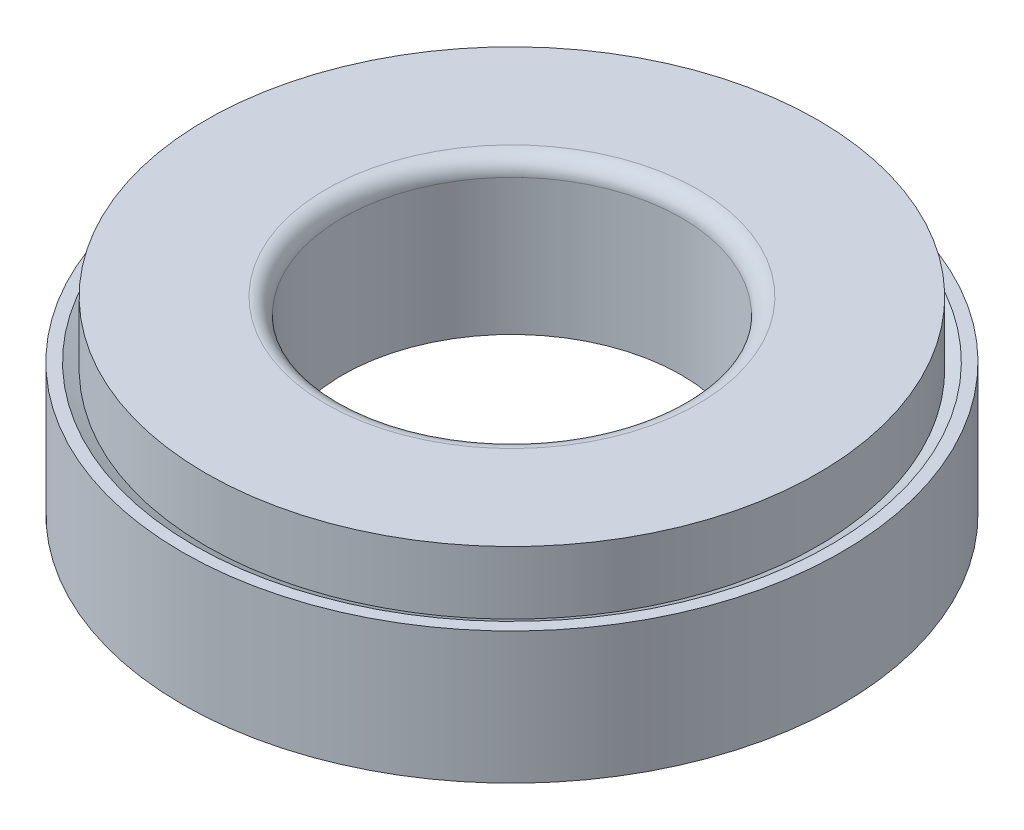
ISO-10303-21;
HEADER;
FILE_DESCRIPTION(('STEP AP214'),'2;1');
FILE_NAME('part.step','',(''),(''),'','','');
FILE_SCHEMA(('AUTOMOTIVE_DESIGN { 1 0 10303 214 1 1 1 1 }'));
ENDSEC;
DATA;
#1=APPLICATION_CONTEXT('core data for automotive mechanical design processes');
#2=APPLICATION_PROTOCOL_DEFINITION('international standard','automotive_design',2000,#1);
#3=PRODUCT_CONTEXT('',#1,'mechanical');
#4=PRODUCT('Part','Part','',(#3));
#5=PRODUCT_RELATED_PRODUCT_CATEGORY('part','',(#4));
#6=PRODUCT_DEFINITION_FORMATION('','',#4);
#7=PRODUCT_DEFINITION_CONTEXT('part definition',#1,'design');
#8=PRODUCT_DEFINITION('design','',#6,#7);
#9=PRODUCT_DEFINITION_SHAPE('','',#8);
#10=(LENGTH_UNIT() NAMED_UNIT(*) SI_UNIT(.MILLI.,.METRE.));
#11=(NAMED_UNIT(*) PLANE_ANGLE_UNIT() SI_UNIT($,.RADIAN.));
#12=(NAMED_UNIT(*) SI_UNIT($,.STERADIAN.) SOLID_ANGLE_UNIT());
#13=UNCERTAINTY_MEASURE_WITH_UNIT(LENGTH_MEASURE(1.E-05),#10,'distance_accuracy_value','');
#14=(GEOMETRIC_REPRESENTATION_CONTEXT(3) GLOBAL_UNCERTAINTY_ASSIGNED_CONTEXT((#13)) GLOBAL_UNIT_ASSIGNED_CONTEXT((#10,
#11,#12)) REPRESENTATION_CONTEXT('',''));
#15=CARTESIAN_POINT('',(0.,0.,0.));
#16=DIRECTION('',(0.,0.,1.));
#17=DIRECTION('',(1.,0.,0.));
#18=AXIS2_PLACEMENT_3D('',#15,#16,#17);
#19=CARTESIAN_POINT('',(0.,20.,0.));
#20=DIRECTION('',(0.,-1.,0.));
#21=DIRECTION('',(0.,0.,-1.));
#22=AXIS2_PLACEMENT_3D('',#19,#20,#21);
#23=CYLINDRICAL_SURFACE('',#22,32.5);
#24=CARTESIAN_POINT('',(0.,13.3084296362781,0.));
#25=DIRECTION('',(0.,1.,0.));
#26=DIRECTION('',(0.,0.,1.));
#27=AXIS2_PLACEMENT_3D('',#24,#25,#26);
#28=CIRCLE('',#27,32.5);
#29=CARTESIAN_POINT('',(0.,13.3084296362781,32.5));
#30=VERTEX_POINT('',#29);
#31=EDGE_CURVE('P0_E29',#30,#30,#28,.T.);
#32=ORIENTED_EDGE('',*,*,#31,.T.);
#33=EDGE_LOOP('',(#32));
#34=FACE_BOUND('',#33,.T.);
#35=CARTESIAN_POINT('',(0.,20.,0.));
#36=DIRECTION('',(0.,1.,0.));
#37=DIRECTION('',(0.,0.,1.));
#38=AXIS2_PLACEMENT_3D('',#35,#36,#37);
#39=CIRCLE('',#38,32.5);
#40=CARTESIAN_POINT('',(0.,20.,32.5));
#41=VERTEX_POINT('',#40);
#42=EDGE_CURVE('P0_E25',#41,#41,#39,.T.);
#43=ORIENTED_EDGE('',*,*,#42,.F.);
#44=EDGE_LOOP('',(#43));
#45=FACE_BOUND('',#44,.T.);
#46=ADVANCED_FACE('P0_F14',(#34,#45),#23,.T.);
#47=CARTESIAN_POINT('',(0.,20.,0.));
#48=DIRECTION('',(0.,1.,0.));
#49=DIRECTION('',(0.,0.,1.));
#50=AXIS2_PLACEMENT_3D('',#47,#48,#49);
#51=PLANE('',#50);
#52=CARTESIAN_POINT('',(0.,20.,0.));
#53=DIRECTION('',(0.,1.,0.));
#54=DIRECTION('',(0.,0.,1.));
#55=AXIS2_PLACEMENT_3D('',#52,#53,#54);
#56=CIRCLE('',#55,19.75);
#57=CARTESIAN_POINT('',(0.,20.,19.75));
#58=VERTEX_POINT('',#57);
#59=EDGE_CURVE('P0_E21',#58,#58,#56,.F.);
#60=ORIENTED_EDGE('',*,*,#59,.T.);
#61=EDGE_LOOP('',(#60));
#62=FACE_BOUND('',#61,.T.);
#63=ORIENTED_EDGE('',*,*,#42,.T.);
#64=EDGE_LOOP('',(#63));
#65=FACE_BOUND('',#64,.T.);
#66=ADVANCED_FACE('P0_F92',(#62,#65),#51,.T.);
#67=CARTESIAN_POINT('',(0.,73.527008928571,0.));
#68=DIRECTION('',(-1.,0.,0.));
#69=DIRECTION('',(0.,-1.,0.));
#70=AXIS2_PLACEMENT_3D('',#67,#68,#69);
#71=SPHERICAL_SURFACE('',#70,68.4289945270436);
#72=CARTESIAN_POINT('',(0.,73.527008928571,0.));
#73=DIRECTION('',(0.,1.,0.));
#74=DIRECTION('',(0.,0.,1.));
#75=AXIS2_PLACEMENT_3D('',#72,#73,#74);
#76=SPHERICAL_SURFACE('',#75,68.4289945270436);
#77=CARTESIAN_POINT('',(0.,8.4,0.));
#78=DIRECTION('',(0.,1.,0.));
#79=DIRECTION('',(0.,0.,1.));
#80=AXIS2_PLACEMENT_3D('',#77,#78,#79);
#81=CIRCLE('',#80,21.);
#82=CARTESIAN_POINT('',(0.,8.4,21.));
#83=VERTEX_POINT('',#82);
#84=EDGE_CURVE('P0_E49',#83,#83,#81,.T.);
#85=ORIENTED_EDGE('',*,*,#84,.T.);
#86=EDGE_LOOP('',(#85));
#87=FACE_BOUND('',#86,.T.);
#88=ORIENTED_EDGE('',*,*,#31,.F.);
#89=EDGE_LOOP('',(#88));
#90=FACE_BOUND('',#89,.T.);
#91=ADVANCED_FACE('P0_F53',(#87,#90),#76,.T.);
#92=CARTESIAN_POINT('',(0.,3.8,0.));
#93=DIRECTION('',(0.,1.,0.));
#94=DIRECTION('',(0.,0.,1.));
#95=AXIS2_PLACEMENT_3D('',#92,#93,#94);
#96=CYLINDRICAL_SURFACE('',#95,21.);
#97=CARTESIAN_POINT('',(0.,6.10000000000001,0.));
#98=DIRECTION('',(0.,1.,0.));
#99=DIRECTION('',(0.,0.,1.));
#100=AXIS2_PLACEMENT_3D('',#97,#98,#99);
#101=CIRCLE('',#100,21.);
#102=CARTESIAN_POINT('',(0.,6.10000000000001,21.));
#103=VERTEX_POINT('',#102);
#104=EDGE_CURVE('P0_E40',#103,#103,#101,.T.);
#105=ORIENTED_EDGE('',*,*,#104,.F.);
#106=EDGE_LOOP('',(#105));
#107=FACE_BOUND('',#106,.T.);
#108=CARTESIAN_POINT('',(0.,3.8,0.));
#109=DIRECTION('',(0.,1.,0.));
#110=DIRECTION('',(0.,0.,1.));
#111=AXIS2_PLACEMENT_3D('',#108,#109,#110);
#112=CIRCLE('',#111,21.);
#113=CARTESIAN_POINT('',(0.,3.8,21.));
#114=VERTEX_POINT('',#113);
#115=EDGE_CURVE('P0_E33',#114,#114,#112,.T.);
#116=ORIENTED_EDGE('',*,*,#115,.T.);
#117=EDGE_LOOP('',(#116));
#118=FACE_BOUND('',#117,.T.);
#119=ADVANCED_FACE('P0_F75',(#107,#118),#96,.T.);
#120=CARTESIAN_POINT('',(0.,3.8,0.));
#121=DIRECTION('',(0.,1.,0.));
#122=DIRECTION('',(0.,0.,1.));
#123=AXIS2_PLACEMENT_3D('',#120,#121,#122);
#124=PLANE('',#123);
#125=CARTESIAN_POINT('',(0.,3.8,0.));
#126=DIRECTION('',(0.,-1.,0.));
#127=DIRECTION('',(0.,0.,-1.));
#128=AXIS2_PLACEMENT_3D('',#125,#126,#127);
#129=CIRCLE('',#128,18.);
#130=CARTESIAN_POINT('',(0.,3.8,-18.));
#131=VERTEX_POINT('',#130);
#132=EDGE_CURVE('P0_E37',#131,#131,#129,.T.);
#133=ORIENTED_EDGE('',*,*,#132,.F.);
#134=EDGE_LOOP('',(#133));
#135=FACE_BOUND('',#134,.T.);
#136=ORIENTED_EDGE('',*,*,#115,.F.);
#137=EDGE_LOOP('',(#136));
#138=FACE_BOUND('',#137,.T.);
#139=ADVANCED_FACE('P0_F78',(#135,#138),#124,.F.);
#140=CARTESIAN_POINT('',(0.,20.,0.));
#141=DIRECTION('',(0.,-1.,0.));
#142=DIRECTION('',(0.,0.,-1.));
#143=AXIS2_PLACEMENT_3D('',#140,#141,#142);
#144=CYLINDRICAL_SURFACE('',#143,18.);
#145=CARTESIAN_POINT('',(0.,18.25,0.));
#146=DIRECTION('',(0.,1.,0.));
#147=DIRECTION('',(0.,0.,1.));
#148=AXIS2_PLACEMENT_3D('',#145,#146,#147);
#149=CIRCLE('',#148,18.);
#150=CARTESIAN_POINT('',(0.,18.25,18.));
#151=VERTEX_POINT('',#150);
#152=EDGE_CURVE('P0_E10',#151,#151,#149,.T.);
#153=ORIENTED_EDGE('',*,*,#152,.T.);
#154=EDGE_LOOP('',(#153));
#155=FACE_BOUND('',#154,.T.);
#156=ORIENTED_EDGE('',*,*,#132,.T.);
#157=EDGE_LOOP('',(#156));
#158=FACE_BOUND('',#157,.T.);
#159=ADVANCED_FACE('P0_F71',(#155,#158),#144,.F.);
#160=CARTESIAN_POINT('',(-21.,6.10000000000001,0.));
#161=DIRECTION('',(0.,-1.,0.));
#162=DIRECTION('',(0.,0.,-1.));
#163=AXIS2_PLACEMENT_3D('',#160,#161,#162);
#164=PLANE('',#163);
#165=CARTESIAN_POINT('',(0.,6.10000000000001,0.));
#166=DIRECTION('',(0.,1.,0.));
#167=DIRECTION('',(0.,0.,1.));
#168=AXIS2_PLACEMENT_3D('',#165,#166,#167);
#169=CIRCLE('',#168,19.5);
#170=CARTESIAN_POINT('',(0.,6.10000000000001,19.5));
#171=VERTEX_POINT('',#170);
#172=EDGE_CURVE('P0_E43',#171,#171,#169,.T.);
#173=ORIENTED_EDGE('',*,*,#172,.F.);
#174=EDGE_LOOP('',(#173));
#175=FACE_BOUND('',#174,.T.);
#176=ORIENTED_EDGE('',*,*,#104,.T.);
#177=EDGE_LOOP('',(#176));
#178=FACE_BOUND('',#177,.T.);
#179=ADVANCED_FACE('P0_F65',(#175,#178),#164,.F.);
#180=CARTESIAN_POINT('',(0.,20.,0.));
#181=DIRECTION('',(0.,1.,0.));
#182=DIRECTION('',(0.,0.,1.));
#183=AXIS2_PLACEMENT_3D('',#180,#181,#182);
#184=CYLINDRICAL_SURFACE('',#183,19.5);
#185=CARTESIAN_POINT('',(0.,8.4,0.));
#186=DIRECTION('',(0.,1.,0.));
#187=DIRECTION('',(0.,0.,1.));
#188=AXIS2_PLACEMENT_3D('',#185,#186,#187);
#189=CIRCLE('',#188,19.5);
#190=CARTESIAN_POINT('',(0.,8.4,19.5));
#191=VERTEX_POINT('',#190);
#192=EDGE_CURVE('P0_E46',#191,#191,#189,.T.);
#193=ORIENTED_EDGE('',*,*,#192,.F.);
#194=EDGE_LOOP('',(#193));
#195=FACE_BOUND('',#194,.T.);
#196=ORIENTED_EDGE('',*,*,#172,.T.);
#197=EDGE_LOOP('',(#196));
#198=FACE_BOUND('',#197,.T.);
#199=ADVANCED_FACE('P0_F59',(#195,#198),#184,.T.);
#200=CARTESIAN_POINT('',(-21.,8.4,0.));
#201=DIRECTION('',(0.,1.,0.));
#202=DIRECTION('',(0.,0.,1.));
#203=AXIS2_PLACEMENT_3D('',#200,#201,#202);
#204=PLANE('',#203);
#205=ORIENTED_EDGE('',*,*,#84,.F.);
#206=EDGE_LOOP('',(#205));
#207=FACE_BOUND('',#206,.T.);
#208=ORIENTED_EDGE('',*,*,#192,.T.);
#209=EDGE_LOOP('',(#208));
#210=FACE_BOUND('',#209,.T.);
#211=ADVANCED_FACE('P0_F56',(#207,#210),#204,.F.);
#212=CARTESIAN_POINT('',(0.,18.25,0.));
#213=DIRECTION('',(0.,1.,0.));
#214=DIRECTION('',(0.,0.,1.));
#215=AXIS2_PLACEMENT_3D('',#212,#213,#214);
#216=TOROIDAL_SURFACE('',#215,19.75,1.75);
#217=ORIENTED_EDGE('',*,*,#152,.F.);
#218=EDGE_LOOP('',(#217));
#219=FACE_BOUND('',#218,.T.);
#220=ORIENTED_EDGE('',*,*,#59,.F.);
#221=EDGE_LOOP('',(#220));
#222=FACE_BOUND('',#221,.T.);
#223=ADVANCED_FACE('P0_F16',(#219,#222),#216,.T.);
#224=CLOSED_SHELL('',(#46,#66,#91,#119,#139,#159,#179,#199,#211,#223));
#225=MANIFOLD_SOLID_BREP('P0_B1',#224);
#226=CARTESIAN_POINT('',(0.,14.,0.));
#227=DIRECTION('',(0.,-1.,0.));
#228=DIRECTION('',(0.,0.,-1.));
#229=AXIS2_PLACEMENT_3D('',#226,#227,#228);
#230=CYLINDRICAL_SURFACE('',#229,35.);
#231=CARTESIAN_POINT('',(0.,14.,0.));
#232=DIRECTION('',(0.,1.,0.));
#233=DIRECTION('',(0.,0.,1.));
#234=AXIS2_PLACEMENT_3D('',#231,#232,#233);
#235=CIRCLE('',#234,35.);
#236=CARTESIAN_POINT('',(0.,14.,35.));
#237=VERTEX_POINT('',#236);
#238=EDGE_CURVE('P1_E9',#237,#237,#235,.T.);
#239=ORIENTED_EDGE('',*,*,#238,.F.);
#240=EDGE_LOOP('',(#239));
#241=FACE_BOUND('',#240,.T.);
#242=CARTESIAN_POINT('',(0.,0.,0.));
#243=DIRECTION('',(0.,1.,0.));
#244=DIRECTION('',(0.,0.,1.));
#245=AXIS2_PLACEMENT_3D('',#242,#243,#244);
#246=CIRCLE('',#245,35.);
#247=CARTESIAN_POINT('',(0.,0.,35.));
#248=VERTEX_POINT('',#247);
#249=EDGE_CURVE('P1_E20',#248,#248,#246,.T.);
#250=ORIENTED_EDGE('',*,*,#249,.T.);
#251=EDGE_LOOP('',(#250));
#252=FACE_BOUND('',#251,.T.);
#253=ADVANCED_FACE('P1_F13',(#241,#252),#230,.T.);
#254=CARTESIAN_POINT('',(0.,14.,0.));
#255=DIRECTION('',(0.,1.,0.));
#256=DIRECTION('',(0.,0.,1.));
#257=AXIS2_PLACEMENT_3D('',#254,#255,#256);
#258=PLANE('',#257);
#259=CARTESIAN_POINT('',(0.,14.,0.));
#260=DIRECTION('',(0.,1.,0.));
#261=DIRECTION('',(0.,0.,1.));
#262=AXIS2_PLACEMENT_3D('',#259,#260,#261);
#263=CIRCLE('',#262,33.75);
#264=CARTESIAN_POINT('',(0.,14.,33.75));
#265=VERTEX_POINT('',#264);
#266=EDGE_CURVE('P1_E35',#265,#265,#263,.T.);
#267=ORIENTED_EDGE('',*,*,#266,.F.);
#268=EDGE_LOOP('',(#267));
#269=FACE_BOUND('',#268,.T.);
#270=ORIENTED_EDGE('',*,*,#238,.T.);
#271=EDGE_LOOP('',(#270));
#272=FACE_BOUND('',#271,.T.);
#273=ADVANCED_FACE('P1_F55',(#269,#272),#258,.T.);
#274=CARTESIAN_POINT('',(0.,0.,0.));
#275=DIRECTION('',(0.,1.,0.));
#276=DIRECTION('',(0.,0.,1.));
#277=AXIS2_PLACEMENT_3D('',#274,#275,#276);
#278=PLANE('',#277);
#279=CARTESIAN_POINT('',(0.,0.,0.));
#280=DIRECTION('',(0.,-1.,0.));
#281=DIRECTION('',(0.,0.,-1.));
#282=AXIS2_PLACEMENT_3D('',#279,#280,#281);
#283=CIRCLE('',#282,24.);
#284=CARTESIAN_POINT('',(0.,0.,-24.));
#285=VERTEX_POINT('',#284);
#286=EDGE_CURVE('P1_E27',#285,#285,#283,.T.);
#287=ORIENTED_EDGE('',*,*,#286,.F.);
#288=EDGE_LOOP('',(#287));
#289=FACE_BOUND('',#288,.T.);
#290=ORIENTED_EDGE('',*,*,#249,.F.);
#291=EDGE_LOOP('',(#290));
#292=FACE_BOUND('',#291,.T.);
#293=ADVANCED_FACE('P1_F60',(#289,#292),#278,.F.);
#294=CARTESIAN_POINT('',(0.,7.,0.));
#295=DIRECTION('',(0.,-1.,0.));
#296=DIRECTION('',(0.,0.,-1.));
#297=AXIS2_PLACEMENT_3D('',#294,#295,#296);
#298=CYLINDRICAL_SURFACE('',#297,24.);
#299=CARTESIAN_POINT('',(0.,7.,0.));
#300=DIRECTION('',(0.,-1.,0.));
#301=DIRECTION('',(0.,0.,-1.));
#302=AXIS2_PLACEMENT_3D('',#299,#300,#301);
#303=CIRCLE('',#302,24.);
#304=CARTESIAN_POINT('',(0.,7.,-24.));
#305=VERTEX_POINT('',#304);
#306=EDGE_CURVE('P1_E25',#305,#305,#303,.T.);
#307=ORIENTED_EDGE('',*,*,#306,.F.);
#308=EDGE_LOOP('',(#307));
#309=FACE_BOUND('',#308,.T.);
#310=ORIENTED_EDGE('',*,*,#286,.T.);
#311=EDGE_LOOP('',(#310));
#312=FACE_BOUND('',#311,.T.);
#313=ADVANCED_FACE('P1_F67',(#309,#312),#298,.F.);
#314=CARTESIAN_POINT('',(0.,7.,0.));
#315=DIRECTION('',(0.,-1.,0.));
#316=DIRECTION('',(0.,0.,-1.));
#317=AXIS2_PLACEMENT_3D('',#314,#315,#316);
#318=PLANE('',#317);
#319=CARTESIAN_POINT('',(0.,7.,0.));
#320=DIRECTION('',(0.,-1.,0.));
#321=DIRECTION('',(0.,0.,-1.));
#322=AXIS2_PLACEMENT_3D('',#319,#320,#321);
#323=CIRCLE('',#322,21.);
#324=CARTESIAN_POINT('',(0.,7.,-21.));
#325=VERTEX_POINT('',#324);
#326=EDGE_CURVE('P1_E30',#325,#325,#323,.T.);
#327=ORIENTED_EDGE('',*,*,#326,.F.);
#328=EDGE_LOOP('',(#327));
#329=FACE_BOUND('',#328,.T.);
#330=ORIENTED_EDGE('',*,*,#306,.T.);
#331=EDGE_LOOP('',(#330));
#332=FACE_BOUND('',#331,.T.);
#333=ADVANCED_FACE('P1_F52',(#329,#332),#318,.T.);
#334=CARTESIAN_POINT('',(0.,14.,0.));
#335=DIRECTION('',(0.,-1.,0.));
#336=DIRECTION('',(0.,0.,-1.));
#337=AXIS2_PLACEMENT_3D('',#334,#335,#336);
#338=CYLINDRICAL_SURFACE('',#337,21.);
#339=CARTESIAN_POINT('',(0.,8.4,0.));
#340=DIRECTION('',(0.,1.,0.));
#341=DIRECTION('',(0.,0.,1.));
#342=AXIS2_PLACEMENT_3D('',#339,#340,#341);
#343=CIRCLE('',#342,21.);
#344=CARTESIAN_POINT('',(0.,8.4,21.));
#345=VERTEX_POINT('',#344);
#346=EDGE_CURVE('P1_E16',#345,#345,#343,.T.);
#347=ORIENTED_EDGE('',*,*,#346,.T.);
#348=EDGE_LOOP('',(#347));
#349=FACE_BOUND('',#348,.T.);
#350=ORIENTED_EDGE('',*,*,#326,.T.);
#351=EDGE_LOOP('',(#350));
#352=FACE_BOUND('',#351,.T.);
#353=ADVANCED_FACE('P1_F42',(#349,#352),#338,.F.);
#354=CARTESIAN_POINT('',(0.,73.5270089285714,0.));
#355=DIRECTION('',(-1.,0.,0.));
#356=DIRECTION('',(0.,1.,0.));
#357=AXIS2_PLACEMENT_3D('',#354,#355,#356);
#358=SPHERICAL_SURFACE('',#357,68.428994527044);
#359=CARTESIAN_POINT('',(0.,73.5270089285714,0.));
#360=DIRECTION('',(0.,1.,0.));
#361=DIRECTION('',(0.,0.,1.));
#362=AXIS2_PLACEMENT_3D('',#359,#360,#361);
#363=SPHERICAL_SURFACE('',#362,68.428994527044);
#364=ORIENTED_EDGE('',*,*,#266,.T.);
#365=EDGE_LOOP('',(#364));
#366=FACE_BOUND('',#365,.T.);
#367=ORIENTED_EDGE('',*,*,#346,.F.);
#368=EDGE_LOOP('',(#367));
#369=FACE_BOUND('',#368,.T.);
#370=ADVANCED_FACE('P1_F45',(#366,#369),#363,.F.);
#371=CLOSED_SHELL('',(#253,#273,#293,#313,#333,#353,#370));
#372=MANIFOLD_SOLID_BREP('P1_B1',#371);
#373=ADVANCED_BREP_SHAPE_REPRESENTATION('',(#18,#225,#372),#14);
#374=SHAPE_DEFINITION_REPRESENTATION(#9,#373);
ENDSEC;
END-ISO-10303-21;
